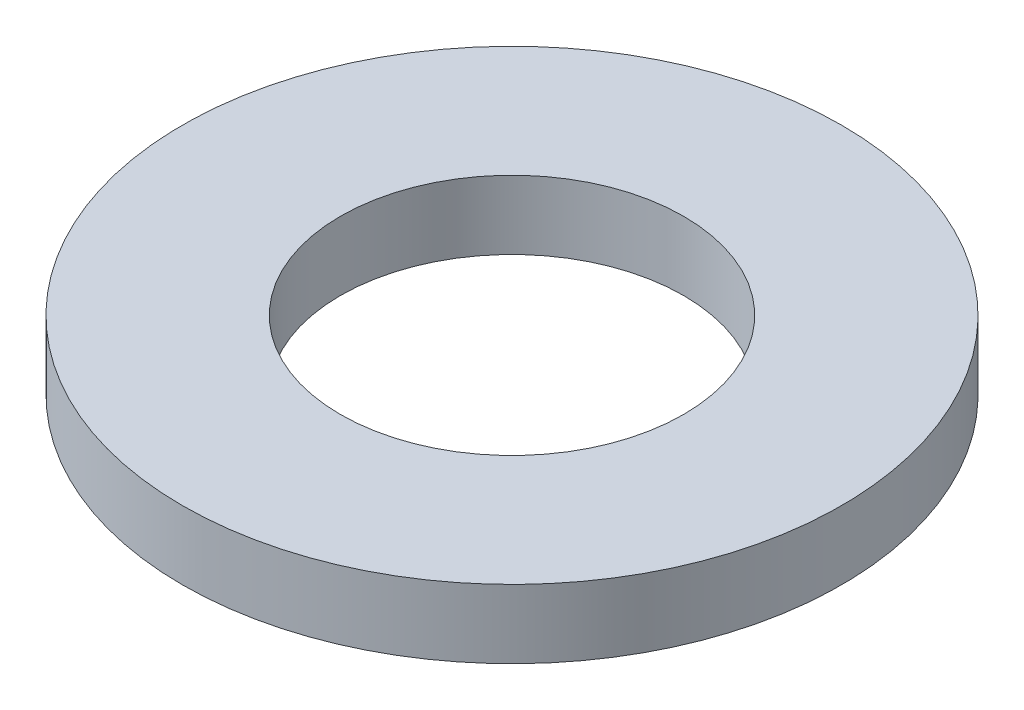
ISO-10303-21;
HEADER;
FILE_DESCRIPTION(('STEP AP214'),'2;1');
FILE_NAME('part.step','',(''),(''),'','','');
FILE_SCHEMA(('AUTOMOTIVE_DESIGN { 1 0 10303 214 1 1 1 1 }'));
ENDSEC;
DATA;
#1=APPLICATION_CONTEXT('core data for automotive mechanical design processes');
#2=APPLICATION_PROTOCOL_DEFINITION('international standard','automotive_design',2000,#1);
#3=PRODUCT_CONTEXT('',#1,'mechanical');
#4=PRODUCT('Part','Part','',(#3));
#5=PRODUCT_RELATED_PRODUCT_CATEGORY('part','',(#4));
#6=PRODUCT_DEFINITION_FORMATION('','',#4);
#7=PRODUCT_DEFINITION_CONTEXT('part definition',#1,'design');
#8=PRODUCT_DEFINITION('design','',#6,#7);
#9=PRODUCT_DEFINITION_SHAPE('','',#8);
#10=(LENGTH_UNIT() NAMED_UNIT(*) SI_UNIT(.MILLI.,.METRE.));
#11=(NAMED_UNIT(*) PLANE_ANGLE_UNIT() SI_UNIT($,.RADIAN.));
#12=(NAMED_UNIT(*) SI_UNIT($,.STERADIAN.) SOLID_ANGLE_UNIT());
#13=UNCERTAINTY_MEASURE_WITH_UNIT(LENGTH_MEASURE(1.E-05),#10,'distance_accuracy_value','');
#14=(GEOMETRIC_REPRESENTATION_CONTEXT(3) GLOBAL_UNCERTAINTY_ASSIGNED_CONTEXT((#13)) GLOBAL_UNIT_ASSIGNED_CONTEXT((#10,
#11,#12)) REPRESENTATION_CONTEXT('',''));
#15=CARTESIAN_POINT('',(0.,0.,0.));
#16=DIRECTION('',(0.,0.,1.));
#17=DIRECTION('',(1.,0.,0.));
#18=AXIS2_PLACEMENT_3D('',#15,#16,#17);
#19=CARTESIAN_POINT('',(0.,2.5,0.));
#20=DIRECTION('',(0.,1.,0.));
#21=DIRECTION('',(0.,0.,1.));
#22=AXIS2_PLACEMENT_3D('',#19,#20,#21);
#23=PLANE('',#22);
#24=CARTESIAN_POINT('',(0.,2.5,0.));
#25=DIRECTION('',(0.,1.,0.));
#26=DIRECTION('',(0.,0.,1.));
#27=AXIS2_PLACEMENT_3D('',#24,#25,#26);
#28=CIRCLE('',#27,12.);
#29=CARTESIAN_POINT('',(0.,2.5,12.));
#30=VERTEX_POINT('',#29);
#31=EDGE_CURVE('E10',#30,#30,#28,.T.);
#32=ORIENTED_EDGE('',*,*,#31,.T.);
#33=EDGE_LOOP('',(#32));
#34=FACE_BOUND('',#33,.T.);
#35=CARTESIAN_POINT('',(0.,2.5,0.));
#36=DIRECTION('',(0.,1.,0.));
#37=DIRECTION('',(0.,0.,1.));
#38=AXIS2_PLACEMENT_3D('',#35,#36,#37);
#39=CIRCLE('',#38,6.25);
#40=CARTESIAN_POINT('',(0.,2.5,6.25));
#41=VERTEX_POINT('',#40);
#42=EDGE_CURVE('E26',#41,#41,#39,.T.);
#43=ORIENTED_EDGE('',*,*,#42,.F.);
#44=EDGE_LOOP('',(#43));
#45=FACE_BOUND('',#44,.T.);
#46=ADVANCED_FACE('F15',(#34,#45),#23,.T.);
#47=CARTESIAN_POINT('',(0.,0.,0.));
#48=DIRECTION('',(0.,1.,0.));
#49=DIRECTION('',(0.,0.,1.));
#50=AXIS2_PLACEMENT_3D('',#47,#48,#49);
#51=PLANE('',#50);
#52=CARTESIAN_POINT('',(0.,0.,0.));
#53=DIRECTION('',(0.,1.,0.));
#54=DIRECTION('',(0.,0.,1.));
#55=AXIS2_PLACEMENT_3D('',#52,#53,#54);
#56=CIRCLE('',#55,12.);
#57=CARTESIAN_POINT('',(0.,0.,12.));
#58=VERTEX_POINT('',#57);
#59=EDGE_CURVE('E22',#58,#58,#56,.T.);
#60=ORIENTED_EDGE('',*,*,#59,.F.);
#61=EDGE_LOOP('',(#60));
#62=FACE_BOUND('',#61,.T.);
#63=CARTESIAN_POINT('',(0.,0.,0.));
#64=DIRECTION('',(0.,1.,0.));
#65=DIRECTION('',(0.,0.,1.));
#66=AXIS2_PLACEMENT_3D('',#63,#64,#65);
#67=CIRCLE('',#66,6.25);
#68=CARTESIAN_POINT('',(0.,0.,6.25));
#69=VERTEX_POINT('',#68);
#70=EDGE_CURVE('E30',#69,#69,#67,.T.);
#71=ORIENTED_EDGE('',*,*,#70,.T.);
#72=EDGE_LOOP('',(#71));
#73=FACE_BOUND('',#72,.T.);
#74=ADVANCED_FACE('F36',(#62,#73),#51,.F.);
#75=CARTESIAN_POINT('',(0.,2.5,0.));
#76=DIRECTION('',(0.,-1.,0.));
#77=DIRECTION('',(0.,0.,-1.));
#78=AXIS2_PLACEMENT_3D('',#75,#76,#77);
#79=CYLINDRICAL_SURFACE('',#78,12.);
#80=ORIENTED_EDGE('',*,*,#31,.F.);
#81=EDGE_LOOP('',(#80));
#82=FACE_BOUND('',#81,.T.);
#83=ORIENTED_EDGE('',*,*,#59,.T.);
#84=EDGE_LOOP('',(#83));
#85=FACE_BOUND('',#84,.T.);
#86=ADVANCED_FACE('F17',(#82,#85),#79,.T.);
#87=CARTESIAN_POINT('',(0.,2.5,0.));
#88=DIRECTION('',(0.,-1.,0.));
#89=DIRECTION('',(0.,0.,-1.));
#90=AXIS2_PLACEMENT_3D('',#87,#88,#89);
#91=CYLINDRICAL_SURFACE('',#90,6.25);
#92=ORIENTED_EDGE('',*,*,#42,.T.);
#93=EDGE_LOOP('',(#92));
#94=FACE_BOUND('',#93,.T.);
#95=ORIENTED_EDGE('',*,*,#70,.F.);
#96=EDGE_LOOP('',(#95));
#97=FACE_BOUND('',#96,.T.);
#98=ADVANCED_FACE('F38',(#94,#97),#91,.F.);
#99=CLOSED_SHELL('',(#46,#74,#86,#98));
#100=MANIFOLD_SOLID_BREP('B1',#99);
#101=ADVANCED_BREP_SHAPE_REPRESENTATION('',(#18,#100),#14);
#102=SHAPE_DEFINITION_REPRESENTATION(#9,#101);
ENDSEC;
END-ISO-10303-21;
